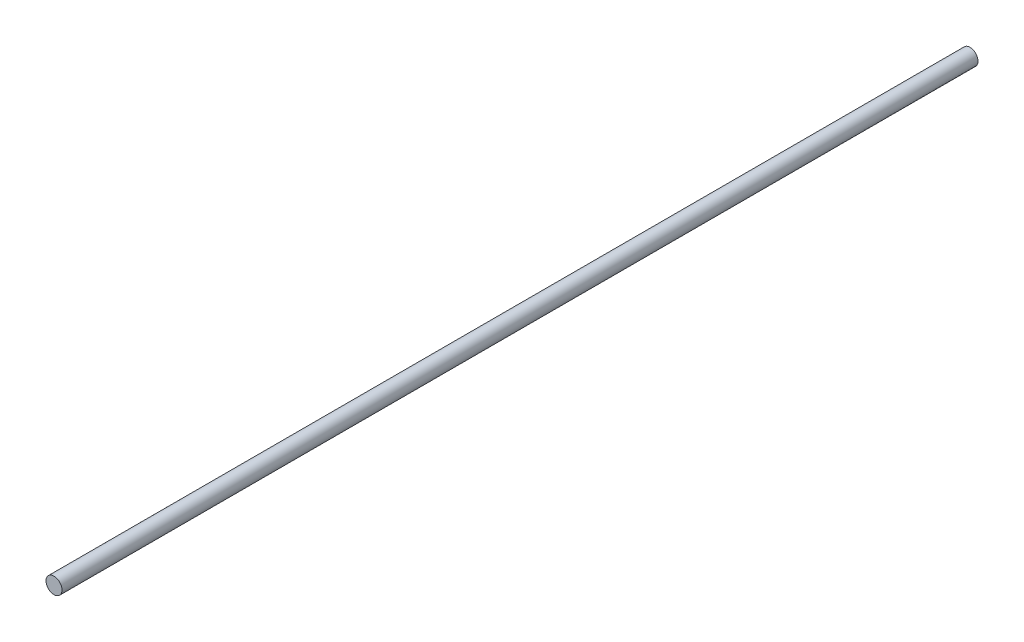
ISO-10303-21;
HEADER;
FILE_DESCRIPTION(('STEP AP214'),'2;1');
FILE_NAME('part.step','',(''),(''),'','','');
FILE_SCHEMA(('AUTOMOTIVE_DESIGN { 1 0 10303 214 1 1 1 1 }'));
ENDSEC;
DATA;
#1=APPLICATION_CONTEXT('core data for automotive mechanical design processes');
#2=APPLICATION_PROTOCOL_DEFINITION('international standard','automotive_design',2000,#1);
#3=PRODUCT_CONTEXT('',#1,'mechanical');
#4=PRODUCT('Part','Part','',(#3));
#5=PRODUCT_RELATED_PRODUCT_CATEGORY('part','',(#4));
#6=PRODUCT_DEFINITION_FORMATION('','',#4);
#7=PRODUCT_DEFINITION_CONTEXT('part definition',#1,'design');
#8=PRODUCT_DEFINITION('design','',#6,#7);
#9=PRODUCT_DEFINITION_SHAPE('','',#8);
#10=(LENGTH_UNIT() NAMED_UNIT(*) SI_UNIT(.MILLI.,.METRE.));
#11=(NAMED_UNIT(*) PLANE_ANGLE_UNIT() SI_UNIT($,.RADIAN.));
#12=(NAMED_UNIT(*) SI_UNIT($,.STERADIAN.) SOLID_ANGLE_UNIT());
#13=UNCERTAINTY_MEASURE_WITH_UNIT(LENGTH_MEASURE(1.E-05),#10,'distance_accuracy_value','');
#14=(GEOMETRIC_REPRESENTATION_CONTEXT(3) GLOBAL_UNCERTAINTY_ASSIGNED_CONTEXT((#13)) GLOBAL_UNIT_ASSIGNED_CONTEXT((#10,
#11,#12)) REPRESENTATION_CONTEXT('',''));
#15=CARTESIAN_POINT('',(0.,0.,0.));
#16=DIRECTION('',(0.,0.,1.));
#17=DIRECTION('',(1.,0.,0.));
#18=AXIS2_PLACEMENT_3D('',#15,#16,#17);
#19=CARTESIAN_POINT('',(0.,0.,171.537168));
#20=DIRECTION('',(0.,0.,1.));
#21=DIRECTION('',(1.,0.,0.));
#22=AXIS2_PLACEMENT_3D('',#19,#20,#21);
#23=PLANE('',#22);
#24=CARTESIAN_POINT('',(0.,0.,171.537168));
#25=DIRECTION('',(0.,0.,1.));
#26=DIRECTION('',(1.,0.,0.));
#27=AXIS2_PLACEMENT_3D('',#24,#25,#26);
#28=CIRCLE('',#27,1.5);
#29=CARTESIAN_POINT('',(1.5,0.,171.537168));
#30=VERTEX_POINT('',#29);
#31=EDGE_CURVE('E10',#30,#30,#28,.T.);
#32=ORIENTED_EDGE('',*,*,#31,.T.);
#33=EDGE_LOOP('',(#32));
#34=FACE_BOUND('',#33,.T.);
#35=ADVANCED_FACE('F16',(#34),#23,.T.);
#36=CARTESIAN_POINT('',(0.,0.,0.));
#37=DIRECTION('',(0.,0.,1.));
#38=DIRECTION('',(1.,0.,0.));
#39=AXIS2_PLACEMENT_3D('',#36,#37,#38);
#40=PLANE('',#39);
#41=CARTESIAN_POINT('',(0.,0.,0.));
#42=DIRECTION('',(0.,0.,1.));
#43=DIRECTION('',(1.,0.,0.));
#44=AXIS2_PLACEMENT_3D('',#41,#42,#43);
#45=CIRCLE('',#44,1.5);
#46=CARTESIAN_POINT('',(1.5,0.,0.));
#47=VERTEX_POINT('',#46);
#48=EDGE_CURVE('E41',#47,#47,#45,.T.);
#49=ORIENTED_EDGE('',*,*,#48,.F.);
#50=EDGE_LOOP('',(#49));
#51=FACE_BOUND('',#50,.T.);
#52=ADVANCED_FACE('F55',(#51),#40,.F.);
#53=CARTESIAN_POINT('',(0.,0.,0.));
#54=DIRECTION('',(0.,0.,-1.));
#55=DIRECTION('',(1.,0.,0.));
#56=AXIS2_PLACEMENT_3D('',#53,#54,#55);
#57=CYLINDRICAL_SURFACE('',#56,1.5);
#58=ORIENTED_EDGE('',*,*,#48,.T.);
#59=DIRECTION('',(0.,0.,1.));
#60=VECTOR('',#59,1.);
#61=CARTESIAN_POINT('',(1.5,0.,0.));
#62=LINE('',#61,#60);
#63=EDGE_CURVE('E24',#47,#30,#62,.T.);
#64=ORIENTED_EDGE('',*,*,#63,.T.);
#65=ORIENTED_EDGE('',*,*,#31,.F.);
#66=ORIENTED_EDGE('',*,*,#63,.F.);
#67=EDGE_LOOP('',(#58,#64,#65,#66));
#68=FACE_BOUND('',#67,.T.);
#69=ADVANCED_FACE('F39',(#68),#57,.T.);
#70=CLOSED_SHELL('',(#35,#52,#69));
#71=MANIFOLD_SOLID_BREP('B1',#70);
#72=ADVANCED_BREP_SHAPE_REPRESENTATION('',(#18,#71),#14);
#73=SHAPE_DEFINITION_REPRESENTATION(#9,#72);
ENDSEC;
END-ISO-10303-21;
